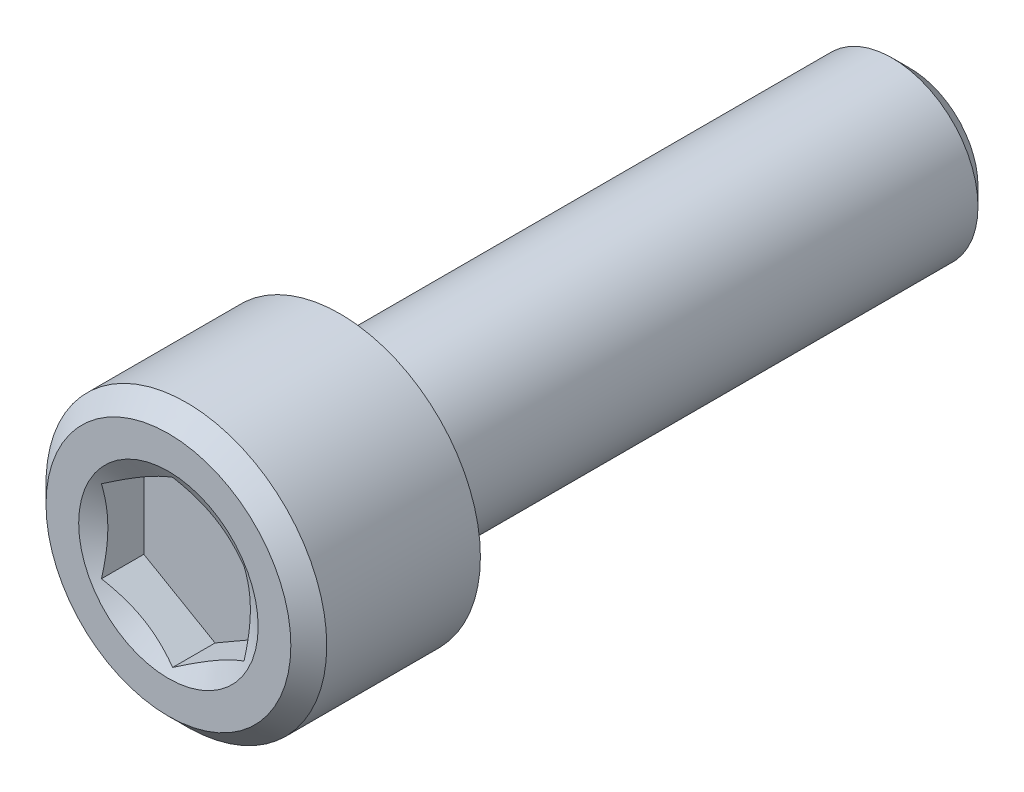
from build123d import *

# Parameters (mm, degrees)
SKE1_R          = 3.91
BASE1_DEPTH     = 4.78
BODYSKE_W       = 20.66
BODYSKE_H       = 2.39
HEX_2_DEPTH     = 1.3
SKE9_R          = 2.5
CHAMFER_2_DEPTH = 1.3
CHAMFER_2_DRAFT = -60
CHAMFER1_SIZE   = 0.5


with BuildPart() as part:
    # Ske1 → Base1 (new body)
    with BuildSketch(Plane.XY):
        Circle(SKE1_R)
    extrude(amount=BASE1_DEPTH)

    # BodySke → BaseBody (revolve)
    with BuildSketch(Plane(origin=(0, 0, 0), x_dir=(0, 0, -1), z_dir=(1, 0, 0)), mode=Mode.PRIVATE) as basebody_sk:
        with Locations((5.55, 1.195)):
            Rectangle(BODYSKE_W, BODYSKE_H)
    revolve(basebody_sk.sketch.rotate(Axis((0, 0, 1.385793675), (0, 0, -1)), 90), axis=Axis((0, 0, 1.385793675), (0, 0, -1)))

    # Ske8 → Hex 2 (cut)
    with BuildSketch(Plane.XY.offset(4.78)):
        Polygon((0, 2.292080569), (-1.985, 1.146040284), (-1.985, -1.146040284), (0, -2.292080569), (1.985, -1.146040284), (1.985, 1.146040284), align=None)
    extrude(amount=-HEX_2_DEPTH, mode=Mode.SUBTRACT)


with BuildPart() as chamfer_2_tool:
    # Ske9 → Chamfer 2 (with draft: the straight prism first)
    with BuildSketch(Plane.XY.offset(4.78)):
        Circle(SKE9_R)
    extrude(amount=-CHAMFER_2_DEPTH)
    # Chamfer 2: the draft: its side faces are tilted about the plane it starts from
    chamfer_2_sides = [chamfer_2_tool.faces().sort_by_distance(p)[0] for p in [
        (-2.5, 0, 4.13),
    ]]
    draft(chamfer_2_sides, Plane.XY.offset(4.78), CHAMFER_2_DRAFT)


with BuildPart() as part_1:
    add(part.part)

    # Chamfer 2: cut by chamfer_2_tool
    add(chamfer_2_tool.part, mode=Mode.SUBTRACT)

    # Chamfer1
    chamfer1_edges = [part_1.edges().sort_by_distance(p)[0] for p in [
        (-3.91, 0, 4.78),
        (-2.39, 0, -15.88),
    ]]
    chamfer(chamfer1_edges, length=CHAMFER1_SIZE)


solid = part_1.part
